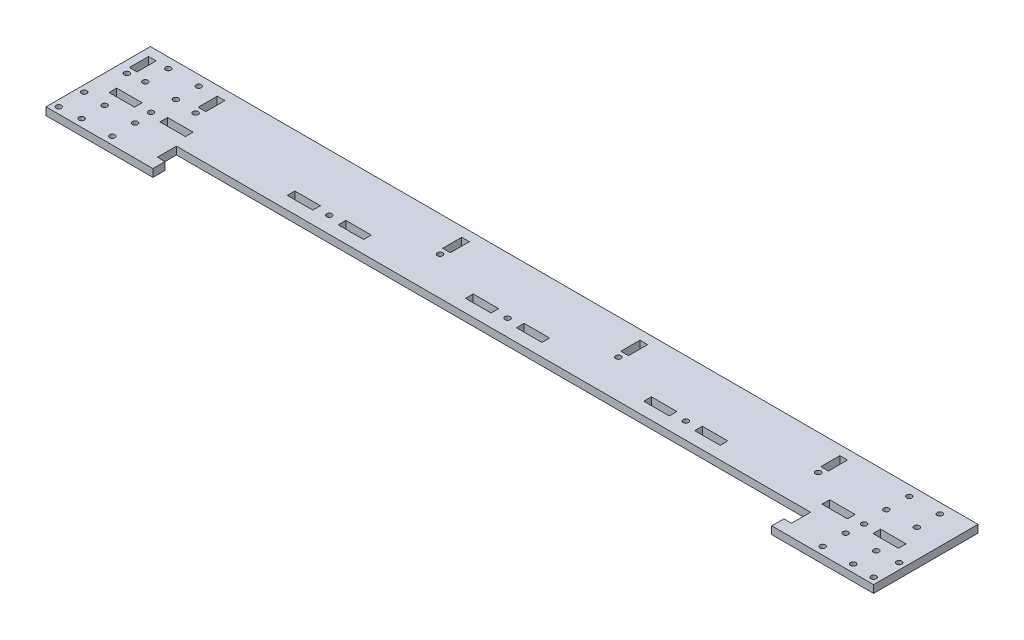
from build123d import *

# Parameters (mm, degrees)
SKETCH_1_W          = 650
SKETCH_1_H          = 75
SKETCH_1_R          = 2.1
SKETCH_1_W_2        = 20
SKETCH_1_H_2        = 6
EXTRUDE_1_DEPTH     = 6
SKETCH_2_W          = 486
SKETCH_2_H          = 24.5
CUT_EXTRUDE_1_DEPTH = 655.340125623
SKETCH_3_W          = 6
SKETCH_3_H          = 15
CUT_EXTRUDE_2_DEPTH = 655.340125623
SKETCH_4_R          = 2.1
SKETCH_4_W          = 6
SKETCH_4_H          = 15
CUT_EXTRUDE_3_DEPTH = 655.340125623
SKETCH_5_W          = 650
SKETCH_5_H          = 7
EXTRUDE_2_DEPTH     = 6
SKETCH_6_R          = 2.1
CUT_EXTRUDE_4_DEPTH = 656.179364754
SKETCH_7_R          = 2.1
CUT_EXTRUDE_5_DEPTH = 656.179364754


with BuildPart() as part:
    # Sketch 1 → Extrude 1 (new body)
    with BuildSketch(Plane(origin=(0, 0, 0), x_dir=(1, 0, 0), z_dir=(0, 1, 0))):
        with Locations((325, 37.5)):
            Rectangle(SKETCH_1_W, SKETCH_1_H)
        with Locations(Location((45, 37.5, 0), (0, 0, 270))):
            Circle(SKETCH_1_R, mode=Mode.SUBTRACT)
        with Locations(Location((185, 37.5, 0), (0, 0, 270))):
            Circle(SKETCH_1_R, mode=Mode.SUBTRACT)
        with Locations(Location((325, 37.5, 0), (0, 0, 270))):
            Circle(SKETCH_1_R, mode=Mode.SUBTRACT)
        with Locations(Location((465, 37.5, 0), (0, 0, 90))):
            Circle(SKETCH_1_R, mode=Mode.SUBTRACT)
        with Locations(Location((605, 37.5, 0), (0, 0, 90))):
            Circle(SKETCH_1_R, mode=Mode.SUBTRACT)
        with Locations((25, 37.5)):
            Rectangle(SKETCH_1_W_2, SKETCH_1_H_2, mode=Mode.SUBTRACT)
        with Locations((65, 37.5)):
            Rectangle(SKETCH_1_W_2, SKETCH_1_H_2, mode=Mode.SUBTRACT)
        with Locations((165, 37.5)):
            Rectangle(SKETCH_1_W_2, SKETCH_1_H_2, mode=Mode.SUBTRACT)
        with Locations((205, 37.5)):
            Rectangle(SKETCH_1_W_2, SKETCH_1_H_2, mode=Mode.SUBTRACT)
        with Locations((305, 37.5)):
            Rectangle(SKETCH_1_W_2, SKETCH_1_H_2, mode=Mode.SUBTRACT)
        with Locations((345, 37.5)):
            Rectangle(SKETCH_1_W_2, SKETCH_1_H_2, mode=Mode.SUBTRACT)
        with Locations((445, 37.5)):
            Rectangle(SKETCH_1_W_2, SKETCH_1_H_2, mode=Mode.SUBTRACT)
        with Locations((485, 37.5)):
            Rectangle(SKETCH_1_W_2, SKETCH_1_H_2, mode=Mode.SUBTRACT)
        with Locations((585, 37.5)):
            Rectangle(SKETCH_1_W_2, SKETCH_1_H_2, mode=Mode.SUBTRACT)
        with Locations((625, 37.5)):
            Rectangle(SKETCH_1_W_2, SKETCH_1_H_2, mode=Mode.SUBTRACT)
    extrude(amount=EXTRUDE_1_DEPTH)

    # Sketch 2 → Cut-Extrude 1 (cut, through all)
    with BuildSketch(Plane(origin=(0, 6, 0), x_dir=(1, 0, 0), z_dir=(0, 1, 0))):
        with Locations((327, 12.25)):
            Rectangle(SKETCH_2_W, SKETCH_2_H)
    extrude(amount=-CUT_EXTRUDE_1_DEPTH, mode=Mode.SUBTRACT)

    # Sketch 3 → Cut-Extrude 2 (cut, through all)
    with BuildSketch(Plane(origin=(0, 6, 0), x_dir=(1, 0, 0), z_dir=(0, 1, 0))):
        with Locations((81, 17)):
            Rectangle(SKETCH_3_W, SKETCH_3_H)
        with Locations((573, 17)):
            Rectangle(SKETCH_3_W, SKETCH_3_H)
    extrude(amount=-CUT_EXTRUDE_2_DEPTH, mode=Mode.SUBTRACT)

    # Sketch 4 → Cut-Extrude 3 (cut, through all)
    with BuildSketch(Plane(origin=(0, 6, 0), x_dir=(1, 0, 0), z_dir=(0, 1, 0))):
        with Locations(Location((9, 54.5, 0), (0, 0, 270))):
            Circle(SKETCH_4_R)
        with Locations(Location((63, 54.5, 0), (0, 0, 270))):
            Circle(SKETCH_4_R)
        with Locations(Location((255, 54.5, 0), (0, 0, 270))):
            Circle(SKETCH_4_R)
        with Locations(Location((395, 54.5, 0), (0, 0, 270))):
            Circle(SKETCH_4_R)
        with Locations(Location((552, 54.5, 0), (0, 0, 270))):
            Circle(SKETCH_4_R)
        with Locations((9, 67)):
            Rectangle(SKETCH_4_W, SKETCH_4_H)
        with Locations((63, 67)):
            Rectangle(SKETCH_4_W, SKETCH_4_H)
        with Locations((255, 67)):
            Rectangle(SKETCH_4_W, SKETCH_4_H)
        with Locations((395, 67)):
            Rectangle(SKETCH_4_W, SKETCH_4_H)
        with Locations((552, 67)):
            Rectangle(SKETCH_4_W, SKETCH_4_H)
    extrude(amount=-CUT_EXTRUDE_3_DEPTH, mode=Mode.SUBTRACT)

    # Sketch 5 → Extrude 2 (add)
    with BuildSketch(Plane(origin=(0, 6, 0), x_dir=(1, 0, 0), z_dir=(0, 1, 0))):
        with Locations((325, 78.5)):
            Rectangle(SKETCH_5_W, SKETCH_5_H)
    extrude(amount=-EXTRUDE_2_DEPTH)

    # Sketch 6 → Cut-Extrude 4 (cut, through all)
    with BuildSketch(Plane(origin=(0, 6, 0), x_dir=(1, 0, 0), z_dir=(0, 1, 0))):
        with Locations(Location((22, 74, 0), (0, 0, 270))):
            Circle(SKETCH_6_R)
        with Locations(Location((46, 74, 0), (0, 0, 270))):
            Circle(SKETCH_6_R)
        with Locations(Location((46, 56, 0), (0, 0, 270))):
            Circle(SKETCH_6_R)
        with Locations(Location((22, 56, 0), (0, 0, 270))):
            Circle(SKETCH_6_R)
        with Locations(Location((22, 24, 0), (0, 0, 270))):
            Circle(SKETCH_6_R)
        with Locations(Location((46, 24, 0), (0, 0, 270))):
            Circle(SKETCH_6_R)
        with Locations(Location((46, 6, 0), (0, 0, 270))):
            Circle(SKETCH_6_R)
        with Locations(Location((22, 6, 0), (0, 0, 270))):
            Circle(SKETCH_6_R)
        with Locations(Location((628, 6, 0), (0, 0, 90))):
            Circle(SKETCH_6_R)
        with Locations(Location((604, 6, 0), (0, 0, 90))):
            Circle(SKETCH_6_R)
        with Locations(Location((604, 24, 0), (0, 0, 90))):
            Circle(SKETCH_6_R)
        with Locations(Location((628, 24, 0), (0, 0, 90))):
            Circle(SKETCH_6_R)
        with Locations(Location((628, 56, 0), (0, 0, 90))):
            Circle(SKETCH_6_R)
        with Locations(Location((604, 56, 0), (0, 0, 90))):
            Circle(SKETCH_6_R)
        with Locations(Location((604, 74, 0), (0, 0, 90))):
            Circle(SKETCH_6_R)
        with Locations(Location((628, 74, 0), (0, 0, 90))):
            Circle(SKETCH_6_R)
    extrude(amount=-CUT_EXTRUDE_4_DEPTH, mode=Mode.SUBTRACT)

    # Sketch 7 → Cut-Extrude 5 (cut, through all)
    with BuildSketch(Plane(origin=(0, 6, 0), x_dir=(1, 0, 0), z_dir=(0, 1, 0))):
        with Locations(Location((5, 25, 0), (0, 0, 270))):
            Circle(SKETCH_7_R)
        with Locations(Location((5, 5, 0), (0, 0, 270))):
            Circle(SKETCH_7_R)
        with Locations(Location((645, 5, 0), (0, 0, 90))):
            Circle(SKETCH_7_R)
        with Locations(Location((645, 25, 0), (0, 0, 90))):
            Circle(SKETCH_7_R)
    extrude(amount=-CUT_EXTRUDE_5_DEPTH, mode=Mode.SUBTRACT)


solid = part.part
